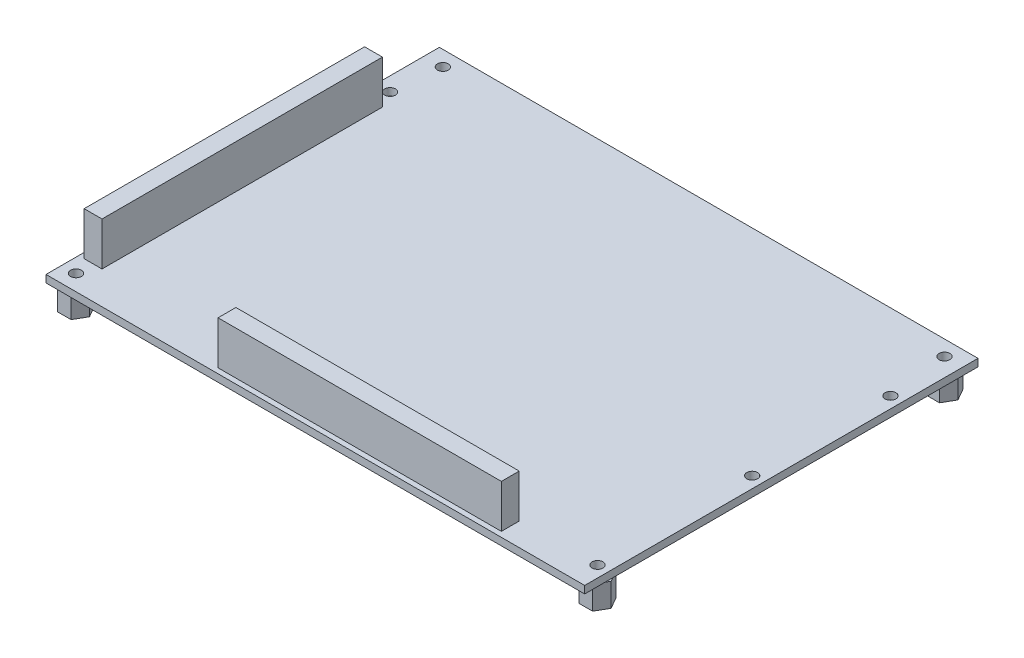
from build123d import *
from build123d.topology import SkipClean

# Parameters (mm, degrees)
SKETCH1_R      = 1.4732
EXTRUDE1_DEPTH = 2.0066
SKETCH3_W      = 76.7588
SKETCH3_H      = 4.8387
SKETCH3_W_2    = 4.8387
SKETCH3_H_2    = 75.9714
EXTRUDE3_DEPTH = 11.7348
EXTRUDE4_START = 6.35
SKETCH4_R      = 1.4732
EXTRUDE4_DEPTH = 6.35


with BuildPart() as part:
    # Sketch1 → Extrude1 (new body)
    with BuildSketch(Plane(origin=(0, 0, 0), x_dir=(1, 0, 0), z_dir=(0, 1, 0))):
        Polygon((0, 92.5957), (0, 106.5657), (145.9357, 106.5657), (145.9357, 92.5957), (145.9357, 0), (0, 0), align=None)
        with Locations(Location((3.81, 89.408, 0), (0, 0, 270))):
            Circle(SKETCH1_R, mode=Mode.SUBTRACT)
        with Locations(Location((3.81, 4.318, 0), (0, 0, 270))):
            Circle(SKETCH1_R, mode=Mode.SUBTRACT)
        with Locations(Location((142.875, 85.9155, 0), (0, 0, 270))):
            Circle(SKETCH1_R, mode=Mode.SUBTRACT)
        with Locations(Location((142.875, 48.4505, 0), (0, 0, 270))):
            Circle(SKETCH1_R, mode=Mode.SUBTRACT)
        with Locations(Location((5.08, 102.4382, 0), (0, 0, 270))):
            Circle(SKETCH1_R, mode=Mode.SUBTRACT)
        with Locations(Location((140.97, 102.4382, 0), (0, 0, 270))):
            Circle(SKETCH1_R, mode=Mode.SUBTRACT)
        with Locations(Location((142.875, 6.5532, 0), (0, 0, 270))):
            Circle(SKETCH1_R, mode=Mode.SUBTRACT)
    extrude(amount=EXTRUDE1_DEPTH)

    # Sketch3 → Extrude3 (add)
    with BuildSketch(Plane.XZ.offset(-2.0066)):
        with Locations((83.5914, -3.81635)):
            Rectangle(SKETCH3_W, SKETCH3_H)
        with Locations((3.89255, -46.8503)):
            Rectangle(SKETCH3_W_2, SKETCH3_H_2)
    extrude(amount=-EXTRUDE3_DEPTH)

    # Sketch4 → Extrude4 (add)
    # profile 1 of 4: a face of its own
    with SkipClean():  # the faces are left unmerged after this step: merging them gives an invalid solid
        with BuildSketch(Plane.XZ.offset(EXTRUDE4_START)):
            Polygon((5.643087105, -7.493), (7.476174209, -4.318), (5.643087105, -1.143), (1.976912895, -1.143), (0.143825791, -4.318), (1.976912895, -7.493), align=None)
            with Locations(Location((3.81, -4.318, 0), (0, 0, 270))):
                Circle(SKETCH4_R, mode=Mode.SUBTRACT)
        # profile 2 of 4: a face of its own
        with BuildSketch(Plane.XZ.offset(EXTRUDE4_START)):
            Polygon((141.041912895, -9.7282), (144.708087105, -9.7282), (146.541174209, -6.5532), (144.708087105, -3.3782), (141.041912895, -3.3782), (139.208825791, -6.5532), align=None)
            with Locations(Location((142.875, -6.5532, 0), (0, 0, 270))):
                Circle(SKETCH4_R, mode=Mode.SUBTRACT)
        # profile 3 of 4: a face of its own
        with BuildSketch(Plane.XZ.offset(EXTRUDE4_START)):
            Polygon((144.636174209, -102.4382), (142.803087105, -99.2632), (139.136912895, -99.2632), (137.303825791, -102.4382), (139.136912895, -105.6132), (142.803087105, -105.6132), align=None)
            with Locations(Location((140.97, -102.4382, 0), (0, 0, 270))):
                Circle(SKETCH4_R, mode=Mode.SUBTRACT)
        # profile 4 of 4: a face of its own
        with BuildSketch(Plane.XZ.offset(EXTRUDE4_START)):
            Polygon((8.746174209, -102.4382), (6.913087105, -99.2632), (3.246912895, -99.2632), (1.413825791, -102.4382), (3.246912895, -105.6132), (6.913087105, -105.6132), align=None)
            with Locations(Location((5.08, -102.4382, 0), (0, 0, 270))):
                Circle(SKETCH4_R, mode=Mode.SUBTRACT)
        extrude(amount=-EXTRUDE4_DEPTH)


solid = part.part
